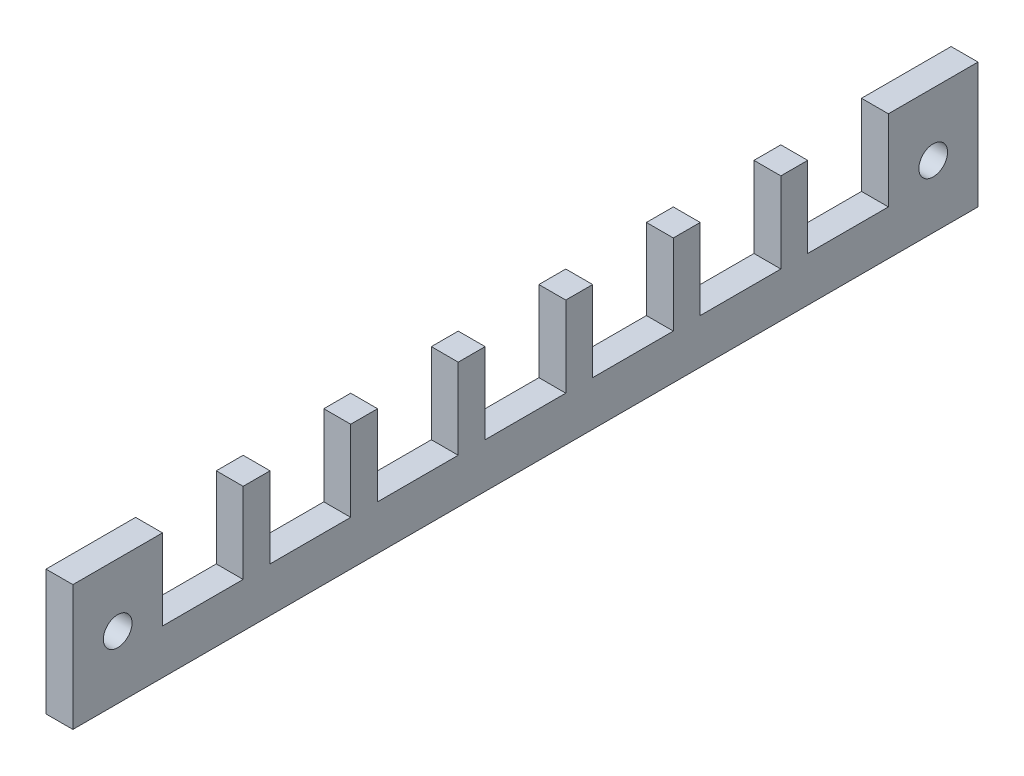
ISO-10303-21;
HEADER;
FILE_DESCRIPTION(('STEP AP214'),'2;1');
FILE_NAME('part.step','',(''),(''),'','','');
FILE_SCHEMA(('AUTOMOTIVE_DESIGN { 1 0 10303 214 1 1 1 1 }'));
ENDSEC;
DATA;
#1=APPLICATION_CONTEXT('core data for automotive mechanical design processes');
#2=APPLICATION_PROTOCOL_DEFINITION('international standard','automotive_design',2000,#1);
#3=PRODUCT_CONTEXT('',#1,'mechanical');
#4=PRODUCT('Part','Part','',(#3));
#5=PRODUCT_RELATED_PRODUCT_CATEGORY('part','',(#4));
#6=PRODUCT_DEFINITION_FORMATION('','',#4);
#7=PRODUCT_DEFINITION_CONTEXT('part definition',#1,'design');
#8=PRODUCT_DEFINITION('design','',#6,#7);
#9=PRODUCT_DEFINITION_SHAPE('','',#8);
#10=(LENGTH_UNIT() NAMED_UNIT(*) SI_UNIT(.MILLI.,.METRE.));
#11=(NAMED_UNIT(*) PLANE_ANGLE_UNIT() SI_UNIT($,.RADIAN.));
#12=(NAMED_UNIT(*) SI_UNIT($,.STERADIAN.) SOLID_ANGLE_UNIT());
#13=UNCERTAINTY_MEASURE_WITH_UNIT(LENGTH_MEASURE(1.E-05),#10,'distance_accuracy_value','');
#14=(GEOMETRIC_REPRESENTATION_CONTEXT(3) GLOBAL_UNCERTAINTY_ASSIGNED_CONTEXT((#13)) GLOBAL_UNIT_ASSIGNED_CONTEXT((#10,
#11,#12)) REPRESENTATION_CONTEXT('',''));
#15=CARTESIAN_POINT('',(0.,0.,0.));
#16=DIRECTION('',(0.,0.,1.));
#17=DIRECTION('',(1.,0.,0.));
#18=AXIS2_PLACEMENT_3D('',#15,#16,#17);
#19=CARTESIAN_POINT('',(4.49999999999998,24.4814087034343,-50.51));
#20=DIRECTION('',(-1.,0.,0.));
#21=DIRECTION('',(0.,0.,1.));
#22=AXIS2_PLACEMENT_3D('',#19,#20,#21);
#23=PLANE('',#22);
#24=CARTESIAN_POINT('',(4.49999999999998,7.,45.5));
#25=DIRECTION('',(-1.,0.,0.));
#26=DIRECTION('',(0.,0.,1.));
#27=AXIS2_PLACEMENT_3D('',#24,#25,#26);
#28=CIRCLE('',#27,1.6);
#29=CARTESIAN_POINT('',(4.49999999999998,7.,47.1));
#30=VERTEX_POINT('',#29);
#31=EDGE_CURVE('E450',#30,#30,#28,.F.);
#32=ORIENTED_EDGE('',*,*,#31,.F.);
#33=EDGE_LOOP('',(#32));
#34=FACE_BOUND('',#33,.T.);
#35=DIRECTION('',(0.,1.,0.));
#36=VECTOR('',#35,1.);
#37=CARTESIAN_POINT('',(4.49999999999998,14.,50.5));
#38=LINE('',#37,#36);
#39=CARTESIAN_POINT('',(4.49999999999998,0.,50.5));
#40=VERTEX_POINT('',#39);
#41=CARTESIAN_POINT('',(4.49999999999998,14.,50.5));
#42=VERTEX_POINT('',#41);
#43=EDGE_CURVE('E442',#40,#42,#38,.T.);
#44=ORIENTED_EDGE('',*,*,#43,.F.);
#45=DIRECTION('',(0.,0.,-1.));
#46=VECTOR('',#45,1.);
#47=CARTESIAN_POINT('',(4.49999999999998,0.,0.));
#48=LINE('',#47,#46);
#49=CARTESIAN_POINT('',(4.49999999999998,0.,-50.5));
#50=VERTEX_POINT('',#49);
#51=EDGE_CURVE('E432',#40,#50,#48,.T.);
#52=ORIENTED_EDGE('',*,*,#51,.T.);
#53=DIRECTION('',(0.,-1.,0.));
#54=VECTOR('',#53,1.);
#55=CARTESIAN_POINT('',(4.49999999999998,14.,-50.5));
#56=LINE('',#55,#54);
#57=CARTESIAN_POINT('',(4.49999999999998,14.,-50.5));
#58=VERTEX_POINT('',#57);
#59=EDGE_CURVE('E445',#58,#50,#56,.T.);
#60=ORIENTED_EDGE('',*,*,#59,.F.);
#61=DIRECTION('',(0.,0.,-1.));
#62=VECTOR('',#61,1.);
#63=CARTESIAN_POINT('',(4.49999999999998,14.,0.));
#64=LINE('',#63,#62);
#65=CARTESIAN_POINT('',(4.49999999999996,14.,-40.5));
#66=VERTEX_POINT('',#65);
#67=EDGE_CURVE('E441',#66,#58,#64,.T.);
#68=ORIENTED_EDGE('',*,*,#67,.F.);
#69=DIRECTION('',(0.,-1.,0.));
#70=VECTOR('',#69,1.);
#71=CARTESIAN_POINT('',(4.49999999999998,-4.,-40.5));
#72=LINE('',#71,#70);
#73=CARTESIAN_POINT('',(4.49999999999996,5.,-40.5));
#74=VERTEX_POINT('',#73);
#75=EDGE_CURVE('E428',#66,#74,#72,.T.);
#76=ORIENTED_EDGE('',*,*,#75,.T.);
#77=DIRECTION('',(0.,0.,-1.));
#78=VECTOR('',#77,1.);
#79=CARTESIAN_POINT('',(4.49999999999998,5.,-40.5));
#80=LINE('',#79,#78);
#81=CARTESIAN_POINT('',(4.49999999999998,5.,-31.5));
#82=VERTEX_POINT('',#81);
#83=EDGE_CURVE('E455',#82,#74,#80,.T.);
#84=ORIENTED_EDGE('',*,*,#83,.F.);
#85=DIRECTION('',(0.,1.,0.));
#86=VECTOR('',#85,1.);
#87=CARTESIAN_POINT('',(4.49999999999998,14.,-31.5));
#88=LINE('',#87,#86);
#89=CARTESIAN_POINT('',(4.49999999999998,14.,-31.5));
#90=VERTEX_POINT('',#89);
#91=EDGE_CURVE('E422',#82,#90,#88,.T.);
#92=ORIENTED_EDGE('',*,*,#91,.T.);
#93=CARTESIAN_POINT('',(4.49999999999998,14.,-28.5));
#94=VERTEX_POINT('',#93);
#95=EDGE_CURVE('E540',#94,#90,#64,.T.);
#96=ORIENTED_EDGE('',*,*,#95,.F.);
#97=DIRECTION('',(0.,-1.,0.));
#98=VECTOR('',#97,1.);
#99=CARTESIAN_POINT('',(4.49999999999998,14.,-28.5));
#100=LINE('',#99,#98);
#101=CARTESIAN_POINT('',(4.49999999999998,5.,-28.5));
#102=VERTEX_POINT('',#101);
#103=EDGE_CURVE('E419',#94,#102,#100,.T.);
#104=ORIENTED_EDGE('',*,*,#103,.T.);
#105=CARTESIAN_POINT('',(4.49999999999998,5.,-19.5));
#106=VERTEX_POINT('',#105);
#107=EDGE_CURVE('E539',#106,#102,#80,.T.);
#108=ORIENTED_EDGE('',*,*,#107,.F.);
#109=DIRECTION('',(0.,1.,0.));
#110=VECTOR('',#109,1.);
#111=CARTESIAN_POINT('',(4.49999999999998,14.,-19.5));
#112=LINE('',#111,#110);
#113=CARTESIAN_POINT('',(4.49999999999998,14.,-19.5));
#114=VERTEX_POINT('',#113);
#115=EDGE_CURVE('E392',#106,#114,#112,.T.);
#116=ORIENTED_EDGE('',*,*,#115,.T.);
#117=CARTESIAN_POINT('',(4.49999999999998,14.,-16.5));
#118=VERTEX_POINT('',#117);
#119=EDGE_CURVE('E541',#118,#114,#64,.T.);
#120=ORIENTED_EDGE('',*,*,#119,.F.);
#121=DIRECTION('',(0.,-1.,0.));
#122=VECTOR('',#121,1.);
#123=CARTESIAN_POINT('',(4.49999999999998,14.,-16.5));
#124=LINE('',#123,#122);
#125=CARTESIAN_POINT('',(4.49999999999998,5.,-16.5));
#126=VERTEX_POINT('',#125);
#127=EDGE_CURVE('E390',#118,#126,#124,.T.);
#128=ORIENTED_EDGE('',*,*,#127,.T.);
#129=CARTESIAN_POINT('',(4.49999999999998,5.,-7.5));
#130=VERTEX_POINT('',#129);
#131=EDGE_CURVE('E251',#130,#126,#80,.T.);
#132=ORIENTED_EDGE('',*,*,#131,.F.);
#133=DIRECTION('',(0.,1.,0.));
#134=VECTOR('',#133,1.);
#135=CARTESIAN_POINT('',(4.49999999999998,14.,-7.5));
#136=LINE('',#135,#134);
#137=CARTESIAN_POINT('',(4.49999999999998,14.,-7.5));
#138=VERTEX_POINT('',#137);
#139=EDGE_CURVE('E399',#130,#138,#136,.T.);
#140=ORIENTED_EDGE('',*,*,#139,.T.);
#141=CARTESIAN_POINT('',(4.49999999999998,14.,-4.5));
#142=VERTEX_POINT('',#141);
#143=EDGE_CURVE('E543',#142,#138,#64,.T.);
#144=ORIENTED_EDGE('',*,*,#143,.F.);
#145=DIRECTION('',(0.,-1.,0.));
#146=VECTOR('',#145,1.);
#147=CARTESIAN_POINT('',(4.49999999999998,14.,-4.5));
#148=LINE('',#147,#146);
#149=CARTESIAN_POINT('',(4.49999999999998,5.,-4.5));
#150=VERTEX_POINT('',#149);
#151=EDGE_CURVE('E396',#142,#150,#148,.T.);
#152=ORIENTED_EDGE('',*,*,#151,.T.);
#153=CARTESIAN_POINT('',(4.49999999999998,5.,4.5));
#154=VERTEX_POINT('',#153);
#155=EDGE_CURVE('E588',#154,#150,#80,.T.);
#156=ORIENTED_EDGE('',*,*,#155,.F.);
#157=DIRECTION('',(0.,1.,0.));
#158=VECTOR('',#157,1.);
#159=CARTESIAN_POINT('',(4.49999999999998,14.,4.5));
#160=LINE('',#159,#158);
#161=CARTESIAN_POINT('',(4.49999999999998,14.,4.5));
#162=VERTEX_POINT('',#161);
#163=EDGE_CURVE('E405',#154,#162,#160,.T.);
#164=ORIENTED_EDGE('',*,*,#163,.T.);
#165=CARTESIAN_POINT('',(4.49999999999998,14.,7.50000000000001));
#166=VERTEX_POINT('',#165);
#167=EDGE_CURVE('E546',#166,#162,#64,.T.);
#168=ORIENTED_EDGE('',*,*,#167,.F.);
#169=DIRECTION('',(0.,-1.,0.));
#170=VECTOR('',#169,1.);
#171=CARTESIAN_POINT('',(4.49999999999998,14.,7.50000000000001));
#172=LINE('',#171,#170);
#173=CARTESIAN_POINT('',(4.49999999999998,5.,7.50000000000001));
#174=VERTEX_POINT('',#173);
#175=EDGE_CURVE('E402',#166,#174,#172,.T.);
#176=ORIENTED_EDGE('',*,*,#175,.T.);
#177=CARTESIAN_POINT('',(4.49999999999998,5.,16.5));
#178=VERTEX_POINT('',#177);
#179=EDGE_CURVE('E577',#178,#174,#80,.T.);
#180=ORIENTED_EDGE('',*,*,#179,.F.);
#181=DIRECTION('',(0.,1.,0.));
#182=VECTOR('',#181,1.);
#183=CARTESIAN_POINT('',(4.49999999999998,14.,16.5));
#184=LINE('',#183,#182);
#185=CARTESIAN_POINT('',(4.49999999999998,14.,16.5));
#186=VERTEX_POINT('',#185);
#187=EDGE_CURVE('E411',#178,#186,#184,.T.);
#188=ORIENTED_EDGE('',*,*,#187,.T.);
#189=CARTESIAN_POINT('',(4.49999999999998,14.,19.5));
#190=VERTEX_POINT('',#189);
#191=EDGE_CURVE('E550',#190,#186,#64,.T.);
#192=ORIENTED_EDGE('',*,*,#191,.F.);
#193=DIRECTION('',(0.,-1.,0.));
#194=VECTOR('',#193,1.);
#195=CARTESIAN_POINT('',(4.49999999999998,14.,19.5));
#196=LINE('',#195,#194);
#197=CARTESIAN_POINT('',(4.49999999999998,5.,19.5));
#198=VERTEX_POINT('',#197);
#199=EDGE_CURVE('E408',#190,#198,#196,.T.);
#200=ORIENTED_EDGE('',*,*,#199,.T.);
#201=CARTESIAN_POINT('',(4.49999999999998,5.,28.5));
#202=VERTEX_POINT('',#201);
#203=EDGE_CURVE('E454',#202,#198,#80,.T.);
#204=ORIENTED_EDGE('',*,*,#203,.F.);
#205=DIRECTION('',(0.,1.,0.));
#206=VECTOR('',#205,1.);
#207=CARTESIAN_POINT('',(4.49999999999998,14.,28.5));
#208=LINE('',#207,#206);
#209=CARTESIAN_POINT('',(4.49999999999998,14.,28.5));
#210=VERTEX_POINT('',#209);
#211=EDGE_CURVE('E416',#202,#210,#208,.T.);
#212=ORIENTED_EDGE('',*,*,#211,.T.);
#213=CARTESIAN_POINT('',(4.49999999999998,14.,31.5));
#214=VERTEX_POINT('',#213);
#215=EDGE_CURVE('E439',#214,#210,#64,.T.);
#216=ORIENTED_EDGE('',*,*,#215,.F.);
#217=DIRECTION('',(0.,-1.,0.));
#218=VECTOR('',#217,1.);
#219=CARTESIAN_POINT('',(4.49999999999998,14.,31.5));
#220=LINE('',#219,#218);
#221=CARTESIAN_POINT('',(4.49999999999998,5.,31.5));
#222=VERTEX_POINT('',#221);
#223=EDGE_CURVE('E414',#214,#222,#220,.T.);
#224=ORIENTED_EDGE('',*,*,#223,.T.);
#225=CARTESIAN_POINT('',(4.49999999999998,5.,40.5));
#226=VERTEX_POINT('',#225);
#227=EDGE_CURVE('E302',#226,#222,#80,.T.);
#228=ORIENTED_EDGE('',*,*,#227,.F.);
#229=DIRECTION('',(0.,1.,0.));
#230=VECTOR('',#229,1.);
#231=CARTESIAN_POINT('',(4.49999999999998,-4.,40.5));
#232=LINE('',#231,#230);
#233=CARTESIAN_POINT('',(4.49999999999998,14.,40.5));
#234=VERTEX_POINT('',#233);
#235=EDGE_CURVE('E425',#226,#234,#232,.T.);
#236=ORIENTED_EDGE('',*,*,#235,.T.);
#237=EDGE_CURVE('E437',#42,#234,#64,.T.);
#238=ORIENTED_EDGE('',*,*,#237,.F.);
#239=EDGE_LOOP('',(#44,#52,#60,#68,#76,#84,#92,#96,#104,#108,#116,#120,#128,#132,#140,#144,#152,
#156,#164,#168,#176,#180,#188,#192,#200,#204,#212,#216,#224,#228,#236,#238));
#240=FACE_BOUND('',#239,.T.);
#241=CARTESIAN_POINT('',(4.49999999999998,7.,-45.5));
#242=DIRECTION('',(-1.,0.,0.));
#243=DIRECTION('',(0.,0.,1.));
#244=AXIS2_PLACEMENT_3D('',#241,#242,#243);
#245=CIRCLE('',#244,1.6);
#246=CARTESIAN_POINT('',(4.49999999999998,7.,-43.9));
#247=VERTEX_POINT('',#246);
#248=EDGE_CURVE('E447',#247,#247,#245,.F.);
#249=ORIENTED_EDGE('',*,*,#248,.F.);
#250=EDGE_LOOP('',(#249));
#251=FACE_BOUND('',#250,.T.);
#252=ADVANCED_FACE('F32',(#34,#240,#251),#23,.F.);
#253=CARTESIAN_POINT('',(1.49999999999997,24.4814087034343,-50.51));
#254=DIRECTION('',(-1.,0.,0.));
#255=DIRECTION('',(0.,0.,1.));
#256=AXIS2_PLACEMENT_3D('',#253,#254,#255);
#257=PLANE('',#256);
#258=DIRECTION('',(0.,1.,0.));
#259=VECTOR('',#258,1.);
#260=CARTESIAN_POINT('',(1.49999999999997,14.,50.5));
#261=LINE('',#260,#259);
#262=CARTESIAN_POINT('',(1.49999999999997,0.,50.5));
#263=VERTEX_POINT('',#262);
#264=CARTESIAN_POINT('',(1.49999999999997,14.,50.5));
#265=VERTEX_POINT('',#264);
#266=EDGE_CURVE('E470',#263,#265,#261,.T.);
#267=ORIENTED_EDGE('',*,*,#266,.T.);
#268=DIRECTION('',(0.,0.,-1.));
#269=VECTOR('',#268,1.);
#270=CARTESIAN_POINT('',(1.49999999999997,14.,0.));
#271=LINE('',#270,#269);
#272=CARTESIAN_POINT('',(1.49999999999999,14.,40.5));
#273=VERTEX_POINT('',#272);
#274=EDGE_CURVE('E440',#265,#273,#271,.T.);
#275=ORIENTED_EDGE('',*,*,#274,.T.);
#276=DIRECTION('',(0.,1.,0.));
#277=VECTOR('',#276,1.);
#278=CARTESIAN_POINT('',(1.49999999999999,-4.,40.5));
#279=LINE('',#278,#277);
#280=CARTESIAN_POINT('',(1.49999999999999,5.,40.5));
#281=VERTEX_POINT('',#280);
#282=EDGE_CURVE('E49',#281,#273,#279,.T.);
#283=ORIENTED_EDGE('',*,*,#282,.F.);
#284=DIRECTION('',(0.,0.,-1.));
#285=VECTOR('',#284,1.);
#286=CARTESIAN_POINT('',(1.49999999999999,5.,-40.5));
#287=LINE('',#286,#285);
#288=CARTESIAN_POINT('',(1.49999999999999,5.,31.5));
#289=VERTEX_POINT('',#288);
#290=EDGE_CURVE('E36',#281,#289,#287,.T.);
#291=ORIENTED_EDGE('',*,*,#290,.T.);
#292=DIRECTION('',(0.,-1.,0.));
#293=VECTOR('',#292,1.);
#294=CARTESIAN_POINT('',(1.49999999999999,14.,31.5));
#295=LINE('',#294,#293);
#296=CARTESIAN_POINT('',(1.49999999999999,14.,31.5));
#297=VERTEX_POINT('',#296);
#298=EDGE_CURVE('E293',#297,#289,#295,.T.);
#299=ORIENTED_EDGE('',*,*,#298,.F.);
#300=CARTESIAN_POINT('',(1.49999999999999,14.,28.5));
#301=VERTEX_POINT('',#300);
#302=EDGE_CURVE('E516',#297,#301,#271,.T.);
#303=ORIENTED_EDGE('',*,*,#302,.T.);
#304=DIRECTION('',(0.,-1.,0.));
#305=VECTOR('',#304,1.);
#306=CARTESIAN_POINT('',(1.49999999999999,14.,28.5));
#307=LINE('',#306,#305);
#308=CARTESIAN_POINT('',(1.49999999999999,5.,28.5));
#309=VERTEX_POINT('',#308);
#310=EDGE_CURVE('E393',#301,#309,#307,.T.);
#311=ORIENTED_EDGE('',*,*,#310,.T.);
#312=DIRECTION('',(0.,0.,-1.));
#313=VECTOR('',#312,1.);
#314=CARTESIAN_POINT('',(1.49999999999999,5.,-40.5));
#315=LINE('',#314,#313);
#316=CARTESIAN_POINT('',(1.49999999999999,5.,19.5));
#317=VERTEX_POINT('',#316);
#318=EDGE_CURVE('E282',#309,#317,#315,.T.);
#319=ORIENTED_EDGE('',*,*,#318,.T.);
#320=DIRECTION('',(0.,-1.,0.));
#321=VECTOR('',#320,1.);
#322=CARTESIAN_POINT('',(1.49999999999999,14.,19.5));
#323=LINE('',#322,#321);
#324=CARTESIAN_POINT('',(1.49999999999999,14.,19.5));
#325=VERTEX_POINT('',#324);
#326=EDGE_CURVE('E322',#325,#317,#323,.T.);
#327=ORIENTED_EDGE('',*,*,#326,.F.);
#328=CARTESIAN_POINT('',(1.49999999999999,14.,16.5));
#329=VERTEX_POINT('',#328);
#330=EDGE_CURVE('E517',#325,#329,#271,.T.);
#331=ORIENTED_EDGE('',*,*,#330,.T.);
#332=DIRECTION('',(0.,-1.,0.));
#333=VECTOR('',#332,1.);
#334=CARTESIAN_POINT('',(1.49999999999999,14.,16.5));
#335=LINE('',#334,#333);
#336=CARTESIAN_POINT('',(1.49999999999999,5.,16.5));
#337=VERTEX_POINT('',#336);
#338=EDGE_CURVE('E480',#329,#337,#335,.T.);
#339=ORIENTED_EDGE('',*,*,#338,.T.);
#340=DIRECTION('',(0.,0.,-1.));
#341=VECTOR('',#340,1.);
#342=CARTESIAN_POINT('',(1.49999999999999,5.,-40.5));
#343=LINE('',#342,#341);
#344=CARTESIAN_POINT('',(1.49999999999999,5.,7.50000000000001));
#345=VERTEX_POINT('',#344);
#346=EDGE_CURVE('E276',#337,#345,#343,.T.);
#347=ORIENTED_EDGE('',*,*,#346,.T.);
#348=DIRECTION('',(0.,-1.,0.));
#349=VECTOR('',#348,1.);
#350=CARTESIAN_POINT('',(1.49999999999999,14.,7.50000000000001));
#351=LINE('',#350,#349);
#352=CARTESIAN_POINT('',(1.49999999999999,14.,7.50000000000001));
#353=VERTEX_POINT('',#352);
#354=EDGE_CURVE('E326',#353,#345,#351,.T.);
#355=ORIENTED_EDGE('',*,*,#354,.F.);
#356=CARTESIAN_POINT('',(1.49999999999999,14.,4.5));
#357=VERTEX_POINT('',#356);
#358=EDGE_CURVE('E520',#353,#357,#271,.T.);
#359=ORIENTED_EDGE('',*,*,#358,.T.);
#360=DIRECTION('',(0.,-1.,0.));
#361=VECTOR('',#360,1.);
#362=CARTESIAN_POINT('',(1.49999999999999,14.,4.5));
#363=LINE('',#362,#361);
#364=CARTESIAN_POINT('',(1.49999999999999,5.,4.5));
#365=VERTEX_POINT('',#364);
#366=EDGE_CURVE('E483',#357,#365,#363,.T.);
#367=ORIENTED_EDGE('',*,*,#366,.T.);
#368=DIRECTION('',(0.,0.,-1.));
#369=VECTOR('',#368,1.);
#370=CARTESIAN_POINT('',(1.49999999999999,5.,-40.5));
#371=LINE('',#370,#369);
#372=CARTESIAN_POINT('',(1.49999999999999,5.,-4.5));
#373=VERTEX_POINT('',#372);
#374=EDGE_CURVE('E271',#365,#373,#371,.T.);
#375=ORIENTED_EDGE('',*,*,#374,.T.);
#376=DIRECTION('',(0.,-1.,0.));
#377=VECTOR('',#376,1.);
#378=CARTESIAN_POINT('',(1.49999999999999,14.,-4.5));
#379=LINE('',#378,#377);
#380=CARTESIAN_POINT('',(1.49999999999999,14.,-4.5));
#381=VERTEX_POINT('',#380);
#382=EDGE_CURVE('E331',#381,#373,#379,.T.);
#383=ORIENTED_EDGE('',*,*,#382,.F.);
#384=CARTESIAN_POINT('',(1.49999999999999,14.,-7.5));
#385=VERTEX_POINT('',#384);
#386=EDGE_CURVE('E524',#381,#385,#271,.T.);
#387=ORIENTED_EDGE('',*,*,#386,.T.);
#388=DIRECTION('',(0.,-1.,0.));
#389=VECTOR('',#388,1.);
#390=CARTESIAN_POINT('',(1.49999999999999,14.,-7.5));
#391=LINE('',#390,#389);
#392=CARTESIAN_POINT('',(1.49999999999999,5.,-7.5));
#393=VERTEX_POINT('',#392);
#394=EDGE_CURVE('E269',#385,#393,#391,.T.);
#395=ORIENTED_EDGE('',*,*,#394,.T.);
#396=DIRECTION('',(0.,0.,-1.));
#397=VECTOR('',#396,1.);
#398=CARTESIAN_POINT('',(1.49999999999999,5.,-40.5));
#399=LINE('',#398,#397);
#400=CARTESIAN_POINT('',(1.49999999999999,5.,-16.5));
#401=VERTEX_POINT('',#400);
#402=EDGE_CURVE('E249',#393,#401,#399,.T.);
#403=ORIENTED_EDGE('',*,*,#402,.T.);
#404=DIRECTION('',(0.,-1.,0.));
#405=VECTOR('',#404,1.);
#406=CARTESIAN_POINT('',(1.49999999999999,14.,-16.5));
#407=LINE('',#406,#405);
#408=CARTESIAN_POINT('',(1.49999999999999,14.,-16.5));
#409=VERTEX_POINT('',#408);
#410=EDGE_CURVE('E255',#409,#401,#407,.T.);
#411=ORIENTED_EDGE('',*,*,#410,.F.);
#412=CARTESIAN_POINT('',(1.49999999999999,14.,-19.5));
#413=VERTEX_POINT('',#412);
#414=EDGE_CURVE('E527',#409,#413,#271,.T.);
#415=ORIENTED_EDGE('',*,*,#414,.T.);
#416=DIRECTION('',(0.,-1.,0.));
#417=VECTOR('',#416,1.);
#418=CARTESIAN_POINT('',(1.49999999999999,14.,-19.5));
#419=LINE('',#418,#417);
#420=CARTESIAN_POINT('',(1.49999999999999,5.,-19.5));
#421=VERTEX_POINT('',#420);
#422=EDGE_CURVE('E487',#413,#421,#419,.T.);
#423=ORIENTED_EDGE('',*,*,#422,.T.);
#424=DIRECTION('',(0.,0.,-1.));
#425=VECTOR('',#424,1.);
#426=CARTESIAN_POINT('',(1.49999999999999,5.,-40.5));
#427=LINE('',#426,#425);
#428=CARTESIAN_POINT('',(1.49999999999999,5.,-28.5));
#429=VERTEX_POINT('',#428);
#430=EDGE_CURVE('E270',#421,#429,#427,.T.);
#431=ORIENTED_EDGE('',*,*,#430,.T.);
#432=DIRECTION('',(0.,-1.,0.));
#433=VECTOR('',#432,1.);
#434=CARTESIAN_POINT('',(1.49999999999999,14.,-28.5));
#435=LINE('',#434,#433);
#436=CARTESIAN_POINT('',(1.49999999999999,14.,-28.5));
#437=VERTEX_POINT('',#436);
#438=EDGE_CURVE('E57',#437,#429,#435,.T.);
#439=ORIENTED_EDGE('',*,*,#438,.F.);
#440=CARTESIAN_POINT('',(1.49999999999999,14.,-31.5));
#441=VERTEX_POINT('',#440);
#442=EDGE_CURVE('E469',#437,#441,#271,.T.);
#443=ORIENTED_EDGE('',*,*,#442,.T.);
#444=DIRECTION('',(0.,-1.,0.));
#445=VECTOR('',#444,1.);
#446=CARTESIAN_POINT('',(1.49999999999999,14.,-31.5));
#447=LINE('',#446,#445);
#448=CARTESIAN_POINT('',(1.49999999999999,5.,-31.5));
#449=VERTEX_POINT('',#448);
#450=EDGE_CURVE('E490',#441,#449,#447,.T.);
#451=ORIENTED_EDGE('',*,*,#450,.T.);
#452=DIRECTION('',(0.,0.,-1.));
#453=VECTOR('',#452,1.);
#454=CARTESIAN_POINT('',(1.49999999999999,5.,-40.5));
#455=LINE('',#454,#453);
#456=CARTESIAN_POINT('',(1.49999999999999,5.,-40.5));
#457=VERTEX_POINT('',#456);
#458=EDGE_CURVE('E284',#449,#457,#455,.T.);
#459=ORIENTED_EDGE('',*,*,#458,.T.);
#460=DIRECTION('',(0.,1.,0.));
#461=VECTOR('',#460,1.);
#462=CARTESIAN_POINT('',(1.49999999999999,-4.,-40.5));
#463=LINE('',#462,#461);
#464=CARTESIAN_POINT('',(1.49999999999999,14.,-40.5));
#465=VERTEX_POINT('',#464);
#466=EDGE_CURVE('E273',#457,#465,#463,.T.);
#467=ORIENTED_EDGE('',*,*,#466,.T.);
#468=CARTESIAN_POINT('',(1.49999999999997,14.,-50.5));
#469=VERTEX_POINT('',#468);
#470=EDGE_CURVE('E466',#465,#469,#271,.T.);
#471=ORIENTED_EDGE('',*,*,#470,.T.);
#472=DIRECTION('',(0.,-1.,0.));
#473=VECTOR('',#472,1.);
#474=CARTESIAN_POINT('',(1.49999999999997,14.,-50.5));
#475=LINE('',#474,#473);
#476=CARTESIAN_POINT('',(1.49999999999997,0.,-50.5));
#477=VERTEX_POINT('',#476);
#478=EDGE_CURVE('E435',#469,#477,#475,.T.);
#479=ORIENTED_EDGE('',*,*,#478,.T.);
#480=DIRECTION('',(0.,0.,-1.));
#481=VECTOR('',#480,1.);
#482=CARTESIAN_POINT('',(1.49999999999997,0.,0.));
#483=LINE('',#482,#481);
#484=EDGE_CURVE('E321',#263,#477,#483,.T.);
#485=ORIENTED_EDGE('',*,*,#484,.F.);
#486=EDGE_LOOP('',(#267,#275,#283,#291,#299,#303,#311,#319,#327,#331,#339,#347,#355,#359,#367,
#375,#383,#387,#395,#403,#411,#415,#423,#431,#439,#443,#451,#459,#467,#471,#479,#485));
#487=FACE_BOUND('',#486,.T.);
#488=CARTESIAN_POINT('',(1.49999999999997,7.,-45.5));
#489=DIRECTION('',(-1.,0.,0.));
#490=DIRECTION('',(0.,0.,1.));
#491=AXIS2_PLACEMENT_3D('',#488,#489,#490);
#492=CIRCLE('',#491,1.6);
#493=CARTESIAN_POINT('',(1.49999999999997,7.,-43.9));
#494=VERTEX_POINT('',#493);
#495=EDGE_CURVE('E436',#494,#494,#492,.F.);
#496=ORIENTED_EDGE('',*,*,#495,.T.);
#497=EDGE_LOOP('',(#496));
#498=FACE_BOUND('',#497,.T.);
#499=CARTESIAN_POINT('',(1.49999999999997,7.,45.5));
#500=DIRECTION('',(-1.,0.,0.));
#501=DIRECTION('',(0.,0.,1.));
#502=AXIS2_PLACEMENT_3D('',#499,#500,#501);
#503=CIRCLE('',#502,1.6);
#504=CARTESIAN_POINT('',(1.49999999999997,7.,47.1));
#505=VERTEX_POINT('',#504);
#506=EDGE_CURVE('E431',#505,#505,#503,.F.);
#507=ORIENTED_EDGE('',*,*,#506,.T.);
#508=EDGE_LOOP('',(#507));
#509=FACE_BOUND('',#508,.T.);
#510=ADVANCED_FACE('F265',(#487,#498,#509),#257,.T.);
#511=CARTESIAN_POINT('',(0.,14.,0.));
#512=DIRECTION('',(0.,-1.,0.));
#513=DIRECTION('',(0.,0.,-1.));
#514=AXIS2_PLACEMENT_3D('',#511,#512,#513);
#515=PLANE('',#514);
#516=ORIENTED_EDGE('',*,*,#274,.F.);
#517=DIRECTION('',(1.,0.,0.));
#518=VECTOR('',#517,1.);
#519=CARTESIAN_POINT('',(-34.5,14.,50.5));
#520=LINE('',#519,#518);
#521=EDGE_CURVE('E461',#265,#42,#520,.T.);
#522=ORIENTED_EDGE('',*,*,#521,.T.);
#523=ORIENTED_EDGE('',*,*,#237,.T.);
#524=DIRECTION('',(-1.,0.,0.));
#525=VECTOR('',#524,1.);
#526=CARTESIAN_POINT('',(1.49999999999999,14.,40.5));
#527=LINE('',#526,#525);
#528=EDGE_CURVE('E340',#234,#273,#527,.T.);
#529=ORIENTED_EDGE('',*,*,#528,.T.);
#530=EDGE_LOOP('',(#516,#522,#523,#529));
#531=FACE_BOUND('',#530,.T.);
#532=ADVANCED_FACE('F515',(#531),#515,.F.);
#533=CARTESIAN_POINT('',(31.5,5.,-40.5));
#534=DIRECTION('',(0.,-1.,0.));
#535=DIRECTION('',(1.,0.,0.));
#536=AXIS2_PLACEMENT_3D('',#533,#534,#535);
#537=PLANE('',#536);
#538=DIRECTION('',(-1.,0.,0.));
#539=VECTOR('',#538,1.);
#540=CARTESIAN_POINT('',(1.49999999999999,5.,40.5));
#541=LINE('',#540,#539);
#542=EDGE_CURVE('E298',#226,#281,#541,.T.);
#543=ORIENTED_EDGE('',*,*,#542,.F.);
#544=ORIENTED_EDGE('',*,*,#227,.T.);
#545=DIRECTION('',(1.,0.,0.));
#546=VECTOR('',#545,1.);
#547=CARTESIAN_POINT('',(1.49999999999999,5.,31.5));
#548=LINE('',#547,#546);
#549=EDGE_CURVE('E300',#289,#222,#548,.T.);
#550=ORIENTED_EDGE('',*,*,#549,.F.);
#551=ORIENTED_EDGE('',*,*,#290,.F.);
#552=EDGE_LOOP('',(#543,#544,#550,#551));
#553=FACE_BOUND('',#552,.T.);
#554=ADVANCED_FACE('F297',(#553),#537,.F.);
#555=ORIENTED_EDGE('',*,*,#302,.F.);
#556=DIRECTION('',(-1.,0.,0.));
#557=VECTOR('',#556,1.);
#558=CARTESIAN_POINT('',(1.49999999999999,14.,31.5));
#559=LINE('',#558,#557);
#560=EDGE_CURVE('E311',#214,#297,#559,.T.);
#561=ORIENTED_EDGE('',*,*,#560,.F.);
#562=ORIENTED_EDGE('',*,*,#215,.T.);
#563=DIRECTION('',(1.,0.,0.));
#564=VECTOR('',#563,1.);
#565=CARTESIAN_POINT('',(1.49999999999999,14.,28.5));
#566=LINE('',#565,#564);
#567=EDGE_CURVE('E317',#301,#210,#566,.T.);
#568=ORIENTED_EDGE('',*,*,#567,.F.);
#569=EDGE_LOOP('',(#555,#561,#562,#568));
#570=FACE_BOUND('',#569,.T.);
#571=ADVANCED_FACE('F559',(#570),#515,.F.);
#572=CARTESIAN_POINT('',(1.49999999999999,14.,31.5));
#573=DIRECTION('',(0.,0.,1.));
#574=DIRECTION('',(-1.,0.,0.));
#575=AXIS2_PLACEMENT_3D('',#572,#573,#574);
#576=PLANE('',#575);
#577=ORIENTED_EDGE('',*,*,#223,.F.);
#578=ORIENTED_EDGE('',*,*,#560,.T.);
#579=ORIENTED_EDGE('',*,*,#298,.T.);
#580=ORIENTED_EDGE('',*,*,#549,.T.);
#581=EDGE_LOOP('',(#577,#578,#579,#580));
#582=FACE_BOUND('',#581,.T.);
#583=ADVANCED_FACE('F309',(#582),#576,.T.);
#584=DIRECTION('',(-1.,0.,0.));
#585=VECTOR('',#584,1.);
#586=CARTESIAN_POINT('',(1.49999999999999,5.,28.5));
#587=LINE('',#586,#585);
#588=EDGE_CURVE('E306',#202,#309,#587,.T.);
#589=ORIENTED_EDGE('',*,*,#588,.F.);
#590=ORIENTED_EDGE('',*,*,#203,.T.);
#591=DIRECTION('',(1.,0.,0.));
#592=VECTOR('',#591,1.);
#593=CARTESIAN_POINT('',(1.49999999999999,5.,19.5));
#594=LINE('',#593,#592);
#595=EDGE_CURVE('E353',#317,#198,#594,.T.);
#596=ORIENTED_EDGE('',*,*,#595,.F.);
#597=ORIENTED_EDGE('',*,*,#318,.F.);
#598=EDGE_LOOP('',(#589,#590,#596,#597));
#599=FACE_BOUND('',#598,.T.);
#600=ADVANCED_FACE('F566',(#599),#537,.F.);
#601=ORIENTED_EDGE('',*,*,#330,.F.);
#602=DIRECTION('',(-1.,0.,0.));
#603=VECTOR('',#602,1.);
#604=CARTESIAN_POINT('',(1.49999999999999,14.,19.5));
#605=LINE('',#604,#603);
#606=EDGE_CURVE('E315',#190,#325,#605,.T.);
#607=ORIENTED_EDGE('',*,*,#606,.F.);
#608=ORIENTED_EDGE('',*,*,#191,.T.);
#609=DIRECTION('',(1.,0.,0.));
#610=VECTOR('',#609,1.);
#611=CARTESIAN_POINT('',(1.49999999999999,14.,16.5));
#612=LINE('',#611,#610);
#613=EDGE_CURVE('E312',#329,#186,#612,.T.);
#614=ORIENTED_EDGE('',*,*,#613,.F.);
#615=EDGE_LOOP('',(#601,#607,#608,#614));
#616=FACE_BOUND('',#615,.T.);
#617=ADVANCED_FACE('F569',(#616),#515,.F.);
#618=CARTESIAN_POINT('',(1.49999999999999,14.,19.5));
#619=DIRECTION('',(0.,0.,1.));
#620=DIRECTION('',(-1.,0.,0.));
#621=AXIS2_PLACEMENT_3D('',#618,#619,#620);
#622=PLANE('',#621);
#623=ORIENTED_EDGE('',*,*,#199,.F.);
#624=ORIENTED_EDGE('',*,*,#606,.T.);
#625=ORIENTED_EDGE('',*,*,#326,.T.);
#626=ORIENTED_EDGE('',*,*,#595,.T.);
#627=EDGE_LOOP('',(#623,#624,#625,#626));
#628=FACE_BOUND('',#627,.T.);
#629=ADVANCED_FACE('F568',(#628),#622,.T.);
#630=DIRECTION('',(-1.,0.,0.));
#631=VECTOR('',#630,1.);
#632=CARTESIAN_POINT('',(1.49999999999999,5.,16.5));
#633=LINE('',#632,#631);
#634=EDGE_CURVE('E305',#178,#337,#633,.T.);
#635=ORIENTED_EDGE('',*,*,#634,.F.);
#636=ORIENTED_EDGE('',*,*,#179,.T.);
#637=DIRECTION('',(1.,0.,0.));
#638=VECTOR('',#637,1.);
#639=CARTESIAN_POINT('',(1.49999999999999,5.,7.50000000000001));
#640=LINE('',#639,#638);
#641=EDGE_CURVE('E348',#345,#174,#640,.T.);
#642=ORIENTED_EDGE('',*,*,#641,.F.);
#643=ORIENTED_EDGE('',*,*,#346,.F.);
#644=EDGE_LOOP('',(#635,#636,#642,#643));
#645=FACE_BOUND('',#644,.T.);
#646=ADVANCED_FACE('F576',(#645),#537,.F.);
#647=ORIENTED_EDGE('',*,*,#358,.F.);
#648=DIRECTION('',(-1.,0.,0.));
#649=VECTOR('',#648,1.);
#650=CARTESIAN_POINT('',(1.49999999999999,14.,7.50000000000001));
#651=LINE('',#650,#649);
#652=EDGE_CURVE('E330',#166,#353,#651,.T.);
#653=ORIENTED_EDGE('',*,*,#652,.F.);
#654=ORIENTED_EDGE('',*,*,#167,.T.);
#655=DIRECTION('',(1.,0.,0.));
#656=VECTOR('',#655,1.);
#657=CARTESIAN_POINT('',(1.49999999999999,14.,4.5));
#658=LINE('',#657,#656);
#659=EDGE_CURVE('E325',#357,#162,#658,.T.);
#660=ORIENTED_EDGE('',*,*,#659,.F.);
#661=EDGE_LOOP('',(#647,#653,#654,#660));
#662=FACE_BOUND('',#661,.T.);
#663=ADVANCED_FACE('F580',(#662),#515,.F.);
#664=CARTESIAN_POINT('',(1.49999999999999,14.,7.50000000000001));
#665=DIRECTION('',(0.,0.,1.));
#666=DIRECTION('',(-1.,0.,0.));
#667=AXIS2_PLACEMENT_3D('',#664,#665,#666);
#668=PLANE('',#667);
#669=ORIENTED_EDGE('',*,*,#175,.F.);
#670=ORIENTED_EDGE('',*,*,#652,.T.);
#671=ORIENTED_EDGE('',*,*,#354,.T.);
#672=ORIENTED_EDGE('',*,*,#641,.T.);
#673=EDGE_LOOP('',(#669,#670,#671,#672));
#674=FACE_BOUND('',#673,.T.);
#675=ADVANCED_FACE('F579',(#674),#668,.T.);
#676=DIRECTION('',(-1.,0.,0.));
#677=VECTOR('',#676,1.);
#678=CARTESIAN_POINT('',(1.49999999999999,5.,4.5));
#679=LINE('',#678,#677);
#680=EDGE_CURVE('E351',#154,#365,#679,.T.);
#681=ORIENTED_EDGE('',*,*,#680,.F.);
#682=ORIENTED_EDGE('',*,*,#155,.T.);
#683=DIRECTION('',(1.,0.,0.));
#684=VECTOR('',#683,1.);
#685=CARTESIAN_POINT('',(1.49999999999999,5.,-4.5));
#686=LINE('',#685,#684);
#687=EDGE_CURVE('E343',#373,#150,#686,.T.);
#688=ORIENTED_EDGE('',*,*,#687,.F.);
#689=ORIENTED_EDGE('',*,*,#374,.F.);
#690=EDGE_LOOP('',(#681,#682,#688,#689));
#691=FACE_BOUND('',#690,.T.);
#692=ADVANCED_FACE('F587',(#691),#537,.F.);
#693=ORIENTED_EDGE('',*,*,#386,.F.);
#694=DIRECTION('',(-1.,0.,0.));
#695=VECTOR('',#694,1.);
#696=CARTESIAN_POINT('',(1.49999999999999,14.,-4.5));
#697=LINE('',#696,#695);
#698=EDGE_CURVE('E334',#142,#381,#697,.T.);
#699=ORIENTED_EDGE('',*,*,#698,.F.);
#700=ORIENTED_EDGE('',*,*,#143,.T.);
#701=DIRECTION('',(1.,0.,0.));
#702=VECTOR('',#701,1.);
#703=CARTESIAN_POINT('',(1.49999999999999,14.,-7.5));
#704=LINE('',#703,#702);
#705=EDGE_CURVE('E329',#385,#138,#704,.T.);
#706=ORIENTED_EDGE('',*,*,#705,.F.);
#707=EDGE_LOOP('',(#693,#699,#700,#706));
#708=FACE_BOUND('',#707,.T.);
#709=ADVANCED_FACE('F591',(#708),#515,.F.);
#710=CARTESIAN_POINT('',(1.49999999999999,14.,-4.5));
#711=DIRECTION('',(0.,0.,1.));
#712=DIRECTION('',(-1.,0.,0.));
#713=AXIS2_PLACEMENT_3D('',#710,#711,#712);
#714=PLANE('',#713);
#715=ORIENTED_EDGE('',*,*,#151,.F.);
#716=ORIENTED_EDGE('',*,*,#698,.T.);
#717=ORIENTED_EDGE('',*,*,#382,.T.);
#718=ORIENTED_EDGE('',*,*,#687,.T.);
#719=EDGE_LOOP('',(#715,#716,#717,#718));
#720=FACE_BOUND('',#719,.T.);
#721=ADVANCED_FACE('F590',(#720),#714,.T.);
#722=DIRECTION('',(-1.,0.,0.));
#723=VECTOR('',#722,1.);
#724=CARTESIAN_POINT('',(1.49999999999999,5.,-7.5));
#725=LINE('',#724,#723);
#726=EDGE_CURVE('E346',#130,#393,#725,.T.);
#727=ORIENTED_EDGE('',*,*,#726,.F.);
#728=ORIENTED_EDGE('',*,*,#131,.T.);
#729=DIRECTION('',(1.,0.,0.));
#730=VECTOR('',#729,1.);
#731=CARTESIAN_POINT('',(1.49999999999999,5.,-16.5));
#732=LINE('',#731,#730);
#733=EDGE_CURVE('E11',#401,#126,#732,.T.);
#734=ORIENTED_EDGE('',*,*,#733,.F.);
#735=ORIENTED_EDGE('',*,*,#402,.F.);
#736=EDGE_LOOP('',(#727,#728,#734,#735));
#737=FACE_BOUND('',#736,.T.);
#738=ADVANCED_FACE('F247',(#737),#537,.F.);
#739=ORIENTED_EDGE('',*,*,#414,.F.);
#740=DIRECTION('',(-1.,0.,0.));
#741=VECTOR('',#740,1.);
#742=CARTESIAN_POINT('',(1.49999999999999,14.,-16.5));
#743=LINE('',#742,#741);
#744=EDGE_CURVE('E258',#118,#409,#743,.T.);
#745=ORIENTED_EDGE('',*,*,#744,.F.);
#746=ORIENTED_EDGE('',*,*,#119,.T.);
#747=DIRECTION('',(1.,0.,0.));
#748=VECTOR('',#747,1.);
#749=CARTESIAN_POINT('',(1.49999999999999,14.,-19.5));
#750=LINE('',#749,#748);
#751=EDGE_CURVE('E333',#413,#114,#750,.T.);
#752=ORIENTED_EDGE('',*,*,#751,.F.);
#753=EDGE_LOOP('',(#739,#745,#746,#752));
#754=FACE_BOUND('',#753,.T.);
#755=ADVANCED_FACE('F603',(#754),#515,.F.);
#756=CARTESIAN_POINT('',(1.49999999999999,14.,-16.5));
#757=DIRECTION('',(0.,0.,1.));
#758=DIRECTION('',(-1.,0.,0.));
#759=AXIS2_PLACEMENT_3D('',#756,#757,#758);
#760=PLANE('',#759);
#761=ORIENTED_EDGE('',*,*,#127,.F.);
#762=ORIENTED_EDGE('',*,*,#744,.T.);
#763=ORIENTED_EDGE('',*,*,#410,.T.);
#764=ORIENTED_EDGE('',*,*,#733,.T.);
#765=EDGE_LOOP('',(#761,#762,#763,#764));
#766=FACE_BOUND('',#765,.T.);
#767=ADVANCED_FACE('F256',(#766),#760,.T.);
#768=DIRECTION('',(-1.,0.,0.));
#769=VECTOR('',#768,1.);
#770=CARTESIAN_POINT('',(1.49999999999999,5.,-19.5));
#771=LINE('',#770,#769);
#772=EDGE_CURVE('E41',#106,#421,#771,.T.);
#773=ORIENTED_EDGE('',*,*,#772,.F.);
#774=ORIENTED_EDGE('',*,*,#107,.T.);
#775=DIRECTION('',(1.,0.,0.));
#776=VECTOR('',#775,1.);
#777=CARTESIAN_POINT('',(1.49999999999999,5.,-28.5));
#778=LINE('',#777,#776);
#779=EDGE_CURVE('E358',#429,#102,#778,.T.);
#780=ORIENTED_EDGE('',*,*,#779,.F.);
#781=ORIENTED_EDGE('',*,*,#430,.F.);
#782=EDGE_LOOP('',(#773,#774,#780,#781));
#783=FACE_BOUND('',#782,.T.);
#784=ADVANCED_FACE('F597',(#783),#537,.F.);
#785=CARTESIAN_POINT('',(1.49999999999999,14.,-19.5));
#786=DIRECTION('',(0.,0.,-1.));
#787=DIRECTION('',(1.,0.,0.));
#788=AXIS2_PLACEMENT_3D('',#785,#786,#787);
#789=PLANE('',#788);
#790=ORIENTED_EDGE('',*,*,#115,.F.);
#791=ORIENTED_EDGE('',*,*,#772,.T.);
#792=ORIENTED_EDGE('',*,*,#422,.F.);
#793=ORIENTED_EDGE('',*,*,#751,.T.);
#794=EDGE_LOOP('',(#790,#791,#792,#793));
#795=FACE_BOUND('',#794,.T.);
#796=ADVANCED_FACE('F602',(#795),#789,.T.);
#797=CARTESIAN_POINT('',(1.49999999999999,14.,-7.5));
#798=DIRECTION('',(0.,0.,-1.));
#799=DIRECTION('',(1.,0.,0.));
#800=AXIS2_PLACEMENT_3D('',#797,#798,#799);
#801=PLANE('',#800);
#802=ORIENTED_EDGE('',*,*,#139,.F.);
#803=ORIENTED_EDGE('',*,*,#726,.T.);
#804=ORIENTED_EDGE('',*,*,#394,.F.);
#805=ORIENTED_EDGE('',*,*,#705,.T.);
#806=EDGE_LOOP('',(#802,#803,#804,#805));
#807=FACE_BOUND('',#806,.T.);
#808=ADVANCED_FACE('F593',(#807),#801,.T.);
#809=CARTESIAN_POINT('',(1.49999999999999,14.,4.5));
#810=DIRECTION('',(0.,0.,-1.));
#811=DIRECTION('',(1.,0.,0.));
#812=AXIS2_PLACEMENT_3D('',#809,#810,#811);
#813=PLANE('',#812);
#814=ORIENTED_EDGE('',*,*,#163,.F.);
#815=ORIENTED_EDGE('',*,*,#680,.T.);
#816=ORIENTED_EDGE('',*,*,#366,.F.);
#817=ORIENTED_EDGE('',*,*,#659,.T.);
#818=EDGE_LOOP('',(#814,#815,#816,#817));
#819=FACE_BOUND('',#818,.T.);
#820=ADVANCED_FACE('F582',(#819),#813,.T.);
#821=CARTESIAN_POINT('',(1.49999999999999,14.,16.5));
#822=DIRECTION('',(0.,0.,-1.));
#823=DIRECTION('',(1.,0.,0.));
#824=AXIS2_PLACEMENT_3D('',#821,#822,#823);
#825=PLANE('',#824);
#826=ORIENTED_EDGE('',*,*,#187,.F.);
#827=ORIENTED_EDGE('',*,*,#634,.T.);
#828=ORIENTED_EDGE('',*,*,#338,.F.);
#829=ORIENTED_EDGE('',*,*,#613,.T.);
#830=EDGE_LOOP('',(#826,#827,#828,#829));
#831=FACE_BOUND('',#830,.T.);
#832=ADVANCED_FACE('F571',(#831),#825,.T.);
#833=CARTESIAN_POINT('',(1.49999999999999,14.,28.5));
#834=DIRECTION('',(0.,0.,-1.));
#835=DIRECTION('',(1.,0.,0.));
#836=AXIS2_PLACEMENT_3D('',#833,#834,#835);
#837=PLANE('',#836);
#838=ORIENTED_EDGE('',*,*,#211,.F.);
#839=ORIENTED_EDGE('',*,*,#588,.T.);
#840=ORIENTED_EDGE('',*,*,#310,.F.);
#841=ORIENTED_EDGE('',*,*,#567,.T.);
#842=EDGE_LOOP('',(#838,#839,#840,#841));
#843=FACE_BOUND('',#842,.T.);
#844=ADVANCED_FACE('F563',(#843),#837,.T.);
#845=ORIENTED_EDGE('',*,*,#442,.F.);
#846=DIRECTION('',(-1.,0.,0.));
#847=VECTOR('',#846,1.);
#848=CARTESIAN_POINT('',(1.49999999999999,14.,-28.5));
#849=LINE('',#848,#847);
#850=EDGE_CURVE('E338',#94,#437,#849,.T.);
#851=ORIENTED_EDGE('',*,*,#850,.F.);
#852=ORIENTED_EDGE('',*,*,#95,.T.);
#853=DIRECTION('',(1.,0.,0.));
#854=VECTOR('',#853,1.);
#855=CARTESIAN_POINT('',(1.49999999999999,14.,-31.5));
#856=LINE('',#855,#854);
#857=EDGE_CURVE('E261',#441,#90,#856,.T.);
#858=ORIENTED_EDGE('',*,*,#857,.F.);
#859=EDGE_LOOP('',(#845,#851,#852,#858));
#860=FACE_BOUND('',#859,.T.);
#861=ADVANCED_FACE('F606',(#860),#515,.F.);
#862=CARTESIAN_POINT('',(1.49999999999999,14.,-28.5));
#863=DIRECTION('',(0.,0.,1.));
#864=DIRECTION('',(-1.,0.,0.));
#865=AXIS2_PLACEMENT_3D('',#862,#863,#864);
#866=PLANE('',#865);
#867=ORIENTED_EDGE('',*,*,#103,.F.);
#868=ORIENTED_EDGE('',*,*,#850,.T.);
#869=ORIENTED_EDGE('',*,*,#438,.T.);
#870=ORIENTED_EDGE('',*,*,#779,.T.);
#871=EDGE_LOOP('',(#867,#868,#869,#870));
#872=FACE_BOUND('',#871,.T.);
#873=ADVANCED_FACE('F600',(#872),#866,.T.);
#874=DIRECTION('',(-1.,0.,0.));
#875=VECTOR('',#874,1.);
#876=CARTESIAN_POINT('',(1.49999999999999,5.,-31.5));
#877=LINE('',#876,#875);
#878=EDGE_CURVE('E361',#82,#449,#877,.T.);
#879=ORIENTED_EDGE('',*,*,#878,.F.);
#880=ORIENTED_EDGE('',*,*,#83,.T.);
#881=DIRECTION('',(1.,0.,0.));
#882=VECTOR('',#881,1.);
#883=CARTESIAN_POINT('',(31.5,5.,-40.5));
#884=LINE('',#883,#882);
#885=EDGE_CURVE('E339',#457,#74,#884,.T.);
#886=ORIENTED_EDGE('',*,*,#885,.F.);
#887=ORIENTED_EDGE('',*,*,#458,.F.);
#888=EDGE_LOOP('',(#879,#880,#886,#887));
#889=FACE_BOUND('',#888,.T.);
#890=ADVANCED_FACE('F538',(#889),#537,.F.);
#891=CARTESIAN_POINT('',(1.49999999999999,14.,-31.5));
#892=DIRECTION('',(0.,0.,-1.));
#893=DIRECTION('',(1.,0.,0.));
#894=AXIS2_PLACEMENT_3D('',#891,#892,#893);
#895=PLANE('',#894);
#896=ORIENTED_EDGE('',*,*,#91,.F.);
#897=ORIENTED_EDGE('',*,*,#878,.T.);
#898=ORIENTED_EDGE('',*,*,#450,.F.);
#899=ORIENTED_EDGE('',*,*,#857,.T.);
#900=EDGE_LOOP('',(#896,#897,#898,#899));
#901=FACE_BOUND('',#900,.T.);
#902=ADVANCED_FACE('F534',(#901),#895,.T.);
#903=CARTESIAN_POINT('',(1.49999999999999,-4.,40.5));
#904=DIRECTION('',(0.,0.,-1.));
#905=DIRECTION('',(1.,0.,0.));
#906=AXIS2_PLACEMENT_3D('',#903,#904,#905);
#907=PLANE('',#906);
#908=ORIENTED_EDGE('',*,*,#235,.F.);
#909=ORIENTED_EDGE('',*,*,#542,.T.);
#910=ORIENTED_EDGE('',*,*,#282,.T.);
#911=ORIENTED_EDGE('',*,*,#528,.F.);
#912=EDGE_LOOP('',(#908,#909,#910,#911));
#913=FACE_BOUND('',#912,.T.);
#914=ADVANCED_FACE('F648',(#913),#907,.T.);
#915=ORIENTED_EDGE('',*,*,#470,.F.);
#916=DIRECTION('',(1.,0.,0.));
#917=VECTOR('',#916,1.);
#918=CARTESIAN_POINT('',(31.5,14.,-40.5));
#919=LINE('',#918,#917);
#920=EDGE_CURVE('E337',#465,#66,#919,.T.);
#921=ORIENTED_EDGE('',*,*,#920,.T.);
#922=ORIENTED_EDGE('',*,*,#67,.T.);
#923=DIRECTION('',(-1.,0.,0.));
#924=VECTOR('',#923,1.);
#925=CARTESIAN_POINT('',(-34.5,14.,-50.5));
#926=LINE('',#925,#924);
#927=EDGE_CURVE('E464',#58,#469,#926,.T.);
#928=ORIENTED_EDGE('',*,*,#927,.T.);
#929=EDGE_LOOP('',(#915,#921,#922,#928));
#930=FACE_BOUND('',#929,.T.);
#931=ADVANCED_FACE('F498',(#930),#515,.F.);
#932=CARTESIAN_POINT('',(31.5,-4.,-40.5));
#933=DIRECTION('',(0.,0.,1.));
#934=DIRECTION('',(-1.,0.,0.));
#935=AXIS2_PLACEMENT_3D('',#932,#933,#934);
#936=PLANE('',#935);
#937=ORIENTED_EDGE('',*,*,#75,.F.);
#938=ORIENTED_EDGE('',*,*,#920,.F.);
#939=ORIENTED_EDGE('',*,*,#466,.F.);
#940=ORIENTED_EDGE('',*,*,#885,.T.);
#941=EDGE_LOOP('',(#937,#938,#939,#940));
#942=FACE_BOUND('',#941,.T.);
#943=ADVANCED_FACE('F495',(#942),#936,.T.);
#944=CARTESIAN_POINT('',(-34.5,14.,-50.5));
#945=DIRECTION('',(0.,0.,1.));
#946=DIRECTION('',(1.,0.,0.));
#947=AXIS2_PLACEMENT_3D('',#944,#945,#946);
#948=PLANE('',#947);
#949=ORIENTED_EDGE('',*,*,#478,.F.);
#950=ORIENTED_EDGE('',*,*,#927,.F.);
#951=ORIENTED_EDGE('',*,*,#59,.T.);
#952=DIRECTION('',(-1.,0.,0.));
#953=VECTOR('',#952,1.);
#954=CARTESIAN_POINT('',(-34.5,0.,-50.5));
#955=LINE('',#954,#953);
#956=EDGE_CURVE('E458',#50,#477,#955,.T.);
#957=ORIENTED_EDGE('',*,*,#956,.T.);
#958=EDGE_LOOP('',(#949,#950,#951,#957));
#959=FACE_BOUND('',#958,.T.);
#960=ADVANCED_FACE('F502',(#959),#948,.F.);
#961=CARTESIAN_POINT('',(-34.5,14.,50.5));
#962=DIRECTION('',(0.,0.,-1.));
#963=DIRECTION('',(-1.,0.,0.));
#964=AXIS2_PLACEMENT_3D('',#961,#962,#963);
#965=PLANE('',#964);
#966=ORIENTED_EDGE('',*,*,#266,.F.);
#967=DIRECTION('',(1.,0.,0.));
#968=VECTOR('',#967,1.);
#969=CARTESIAN_POINT('',(-34.5,0.,50.5));
#970=LINE('',#969,#968);
#971=EDGE_CURVE('E389',#263,#40,#970,.T.);
#972=ORIENTED_EDGE('',*,*,#971,.T.);
#973=ORIENTED_EDGE('',*,*,#43,.T.);
#974=ORIENTED_EDGE('',*,*,#521,.F.);
#975=EDGE_LOOP('',(#966,#972,#973,#974));
#976=FACE_BOUND('',#975,.T.);
#977=ADVANCED_FACE('F508',(#976),#965,.F.);
#978=CARTESIAN_POINT('',(0.,0.,0.));
#979=DIRECTION('',(0.,-1.,0.));
#980=DIRECTION('',(0.,0.,-1.));
#981=AXIS2_PLACEMENT_3D('',#978,#979,#980);
#982=PLANE('',#981);
#983=ORIENTED_EDGE('',*,*,#971,.F.);
#984=ORIENTED_EDGE('',*,*,#484,.T.);
#985=ORIENTED_EDGE('',*,*,#956,.F.);
#986=ORIENTED_EDGE('',*,*,#51,.F.);
#987=EDGE_LOOP('',(#983,#984,#985,#986));
#988=FACE_BOUND('',#987,.T.);
#989=ADVANCED_FACE('F510',(#988),#982,.T.);
#990=CARTESIAN_POINT('',(-34.5,7.,45.5));
#991=DIRECTION('',(1.,0.,0.));
#992=DIRECTION('',(0.,0.,-1.));
#993=AXIS2_PLACEMENT_3D('',#990,#991,#992);
#994=CYLINDRICAL_SURFACE('',#993,1.6);
#995=ORIENTED_EDGE('',*,*,#31,.T.);
#996=EDGE_LOOP('',(#995));
#997=FACE_BOUND('',#996,.T.);
#998=ORIENTED_EDGE('',*,*,#506,.F.);
#999=EDGE_LOOP('',(#998));
#1000=FACE_BOUND('',#999,.T.);
#1001=ADVANCED_FACE('F800',(#997,#1000),#994,.F.);
#1002=CARTESIAN_POINT('',(-34.5,7.,-45.5));
#1003=DIRECTION('',(1.,0.,0.));
#1004=DIRECTION('',(0.,0.,-1.));
#1005=AXIS2_PLACEMENT_3D('',#1002,#1003,#1004);
#1006=CYLINDRICAL_SURFACE('',#1005,1.6);
#1007=ORIENTED_EDGE('',*,*,#248,.T.);
#1008=EDGE_LOOP('',(#1007));
#1009=FACE_BOUND('',#1008,.T.);
#1010=ORIENTED_EDGE('',*,*,#495,.F.);
#1011=EDGE_LOOP('',(#1010));
#1012=FACE_BOUND('',#1011,.T.);
#1013=ADVANCED_FACE('F34',(#1009,#1012),#1006,.F.);
#1014=CLOSED_SHELL('',(#252,#510,#532,#554,#571,#583,#600,#617,#629,#646,#663,#675,#692,#709,
#721,#738,#755,#767,#784,#796,#808,#820,#832,#844,#861,#873,#890,#902,#914,#931,#943,#960,#977,
#989,#1001,#1013));
#1015=MANIFOLD_SOLID_BREP('B2',#1014);
#1016=ADVANCED_BREP_SHAPE_REPRESENTATION('',(#18,#1015),#14);
#1017=SHAPE_DEFINITION_REPRESENTATION(#9,#1016);
ENDSEC;
END-ISO-10303-21;
